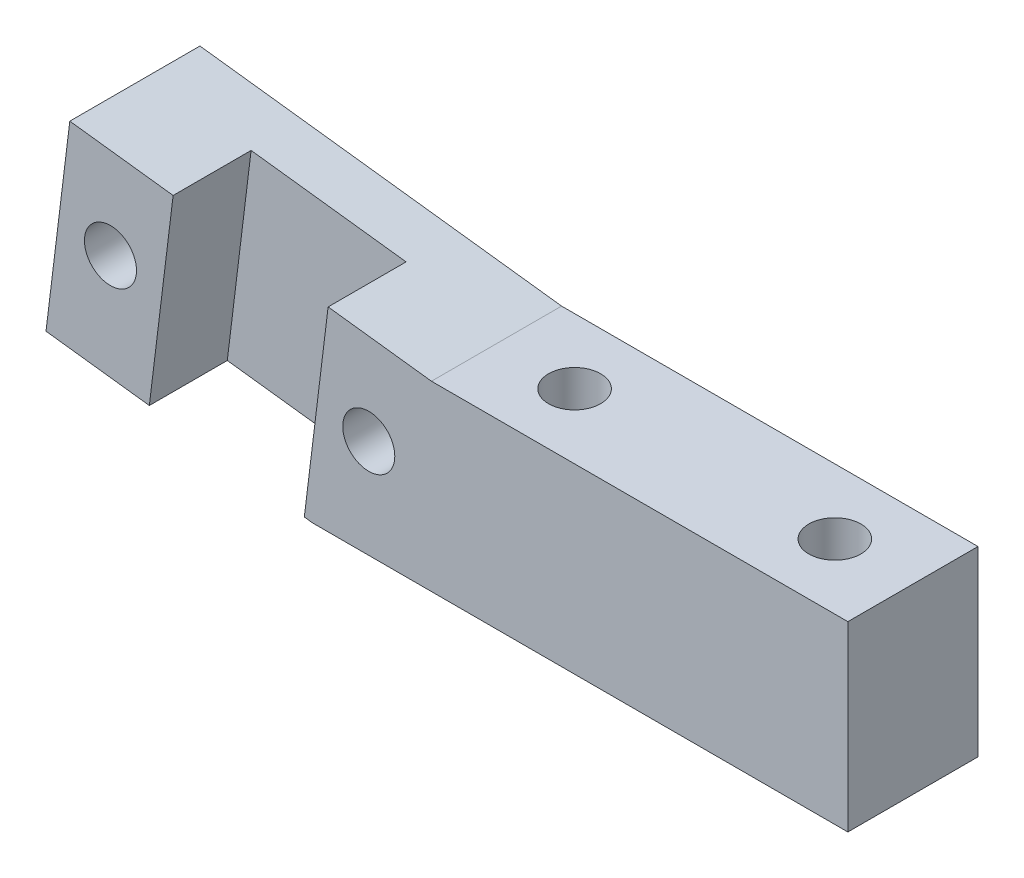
ISO-10303-21;
HEADER;
FILE_DESCRIPTION(('STEP AP214'),'2;1');
FILE_NAME('part.step','',(''),(''),'','','');
FILE_SCHEMA(('AUTOMOTIVE_DESIGN { 1 0 10303 214 1 1 1 1 }'));
ENDSEC;
DATA;
#1=APPLICATION_CONTEXT('core data for automotive mechanical design processes');
#2=APPLICATION_PROTOCOL_DEFINITION('international standard','automotive_design',2000,#1);
#3=PRODUCT_CONTEXT('',#1,'mechanical');
#4=PRODUCT('Part','Part','',(#3));
#5=PRODUCT_RELATED_PRODUCT_CATEGORY('part','',(#4));
#6=PRODUCT_DEFINITION_FORMATION('','',#4);
#7=PRODUCT_DEFINITION_CONTEXT('part definition',#1,'design');
#8=PRODUCT_DEFINITION('design','',#6,#7);
#9=PRODUCT_DEFINITION_SHAPE('','',#8);
#10=(LENGTH_UNIT() NAMED_UNIT(*) SI_UNIT(.MILLI.,.METRE.));
#11=(NAMED_UNIT(*) PLANE_ANGLE_UNIT() SI_UNIT($,.RADIAN.));
#12=(NAMED_UNIT(*) SI_UNIT($,.STERADIAN.) SOLID_ANGLE_UNIT());
#13=UNCERTAINTY_MEASURE_WITH_UNIT(LENGTH_MEASURE(1.E-05),#10,'distance_accuracy_value','');
#14=(GEOMETRIC_REPRESENTATION_CONTEXT(3) GLOBAL_UNCERTAINTY_ASSIGNED_CONTEXT((#13)) GLOBAL_UNIT_ASSIGNED_CONTEXT((#10,
#11,#12)) REPRESENTATION_CONTEXT('',''));
#15=CARTESIAN_POINT('',(0.,0.,0.));
#16=DIRECTION('',(0.,0.,1.));
#17=DIRECTION('',(1.,0.,0.));
#18=AXIS2_PLACEMENT_3D('',#15,#16,#17);
#19=CARTESIAN_POINT('',(0.,0.,7.9375));
#20=DIRECTION('',(0.,0.,-1.));
#21=DIRECTION('',(-1.,0.,0.));
#22=AXIS2_PLACEMENT_3D('',#19,#20,#21);
#23=PLANE('',#22);
#24=CARTESIAN_POINT('',(-39.16018690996,4.80826635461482,7.9375));
#25=DIRECTION('',(0.,0.,1.));
#26=DIRECTION('',(1.,0.,0.));
#27=AXIS2_PLACEMENT_3D('',#24,#25,#26);
#28=CIRCLE('',#27,3.175);
#29=CARTESIAN_POINT('',(-35.98518690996,4.80826635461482,7.9375));
#30=VERTEX_POINT('',#29);
#31=EDGE_CURVE('E206',#30,#30,#28,.T.);
#32=ORIENTED_EDGE('',*,*,#31,.F.);
#33=EDGE_LOOP('',(#32));
#34=FACE_BOUND('',#33,.T.);
#35=DIRECTION('',(-0.12186934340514,-0.992546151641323,0.));
#36=VECTOR('',#35,1.);
#37=CARTESIAN_POINT('',(-32.8575188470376,4.03439602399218,7.9375));
#38=LINE('',#37,#36);
#39=CARTESIAN_POINT('',(-31.513340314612,14.9818516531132,7.9375));
#40=VERTEX_POINT('',#39);
#41=CARTESIAN_POINT('',(-34.4169017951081,-8.66575891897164,7.9375));
#42=VERTEX_POINT('',#41);
#43=EDGE_CURVE('E202',#40,#42,#38,.T.);
#44=ORIENTED_EDGE('',*,*,#43,.F.);
#45=DIRECTION('',(-0.992546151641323,0.121869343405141,0.));
#46=VECTOR('',#45,1.);
#47=CARTESIAN_POINT('',(0.,11.1125,7.9375));
#48=LINE('',#47,#46);
#49=CARTESIAN_POINT('',(-44.1186764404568,16.5295923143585,7.9375));
#50=VERTEX_POINT('',#49);
#51=EDGE_CURVE('E124',#40,#50,#48,.T.);
#52=ORIENTED_EDGE('',*,*,#51,.T.);
#53=DIRECTION('',(-0.12186934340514,-0.992546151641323,0.));
#54=VECTOR('',#53,1.);
#55=CARTESIAN_POINT('',(-47.0222379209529,-7.11801825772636,7.9375));
#56=LINE('',#55,#54);
#57=CARTESIAN_POINT('',(-47.0222379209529,-7.11801825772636,7.9375));
#58=VERTEX_POINT('',#57);
#59=EDGE_CURVE('E117',#50,#58,#56,.T.);
#60=ORIENTED_EDGE('',*,*,#59,.T.);
#61=DIRECTION('',(0.992546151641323,-0.12186934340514,0.));
#62=VECTOR('',#61,1.);
#63=CARTESIAN_POINT('',(-14.4897948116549,-11.1125,7.9375));
#64=LINE('',#63,#62);
#65=EDGE_CURVE('E122',#58,#42,#64,.T.);
#66=ORIENTED_EDGE('',*,*,#65,.T.);
#67=EDGE_LOOP('',(#44,#52,#60,#66));
#68=FACE_BOUND('',#67,.T.);
#69=ADVANCED_FACE('F45',(#34,#68),#23,.F.);
#70=CARTESIAN_POINT('',(-7.64684659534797,0.938914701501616,7.9375));
#71=DIRECTION('',(0.,0.,1.));
#72=DIRECTION('',(1.,0.,0.));
#73=AXIS2_PLACEMENT_3D('',#70,#71,#72);
#74=CIRCLE('',#73,3.175);
#75=CARTESIAN_POINT('',(-4.47184659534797,0.938914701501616,7.9375));
#76=VERTEX_POINT('',#75);
#77=EDGE_CURVE('E153',#76,#76,#74,.T.);
#78=ORIENTED_EDGE('',*,*,#77,.F.);
#79=EDGE_LOOP('',(#78));
#80=FACE_BOUND('',#79,.T.);
#81=DIRECTION('',(0.12186934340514,0.992546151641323,0.));
#82=VECTOR('',#81,1.);
#83=CARTESIAN_POINT('',(-13.9495146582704,1.71278503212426,7.9375));
#84=LINE('',#83,#82);
#85=CARTESIAN_POINT('',(-15.5088976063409,-10.9873699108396,7.9375));
#86=VERTEX_POINT('',#85);
#87=CARTESIAN_POINT('',(-12.6053361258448,12.6602406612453,7.9375));
#88=VERTEX_POINT('',#87);
#89=EDGE_CURVE('E199',#86,#88,#84,.T.);
#90=ORIENTED_EDGE('',*,*,#89,.F.);
#91=CARTESIAN_POINT('',(-14.4897948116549,-11.1125,7.9375));
#92=VERTEX_POINT('',#91);
#93=EDGE_CURVE('E128',#86,#92,#64,.T.);
#94=ORIENTED_EDGE('',*,*,#93,.T.);
#95=DIRECTION('',(1.,0.,0.));
#96=VECTOR('',#95,1.);
#97=CARTESIAN_POINT('',(50.8,-11.1125,7.9375));
#98=LINE('',#97,#96);
#99=CARTESIAN_POINT('',(50.8,-11.1125,7.9375));
#100=VERTEX_POINT('',#99);
#101=EDGE_CURVE('E70',#92,#100,#98,.T.);
#102=ORIENTED_EDGE('',*,*,#101,.T.);
#103=DIRECTION('',(0.,1.,0.));
#104=VECTOR('',#103,1.);
#105=CARTESIAN_POINT('',(50.8,11.1125,7.9375));
#106=LINE('',#105,#104);
#107=CARTESIAN_POINT('',(50.8,11.1125,7.9375));
#108=VERTEX_POINT('',#107);
#109=EDGE_CURVE('E161',#100,#108,#106,.T.);
#110=ORIENTED_EDGE('',*,*,#109,.T.);
#111=DIRECTION('',(-1.,0.,0.));
#112=VECTOR('',#111,1.);
#113=CARTESIAN_POINT('',(0.,11.1125,7.9375));
#114=LINE('',#113,#112);
#115=CARTESIAN_POINT('',(0.,11.1125,7.9375));
#116=VERTEX_POINT('',#115);
#117=EDGE_CURVE('E106',#108,#116,#114,.T.);
#118=ORIENTED_EDGE('',*,*,#117,.T.);
#119=EDGE_CURVE('E129',#116,#88,#48,.T.);
#120=ORIENTED_EDGE('',*,*,#119,.T.);
#121=EDGE_LOOP('',(#90,#94,#102,#110,#118,#120));
#122=FACE_BOUND('',#121,.T.);
#123=ADVANCED_FACE('F221',(#80,#122),#23,.F.);
#124=CARTESIAN_POINT('',(0.,11.1125,7.9375));
#125=DIRECTION('',(-0.121869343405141,-0.992546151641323,0.));
#126=DIRECTION('',(0.992546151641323,-0.121869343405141,0.));
#127=AXIS2_PLACEMENT_3D('',#124,#125,#126);
#128=PLANE('',#127);
#129=DIRECTION('',(0.,0.,-1.));
#130=VECTOR('',#129,1.);
#131=CARTESIAN_POINT('',(-31.513340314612,14.9818516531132,14.3002));
#132=LINE('',#131,#130);
#133=CARTESIAN_POINT('',(-31.513340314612,14.9818516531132,-1.5748));
#134=VERTEX_POINT('',#133);
#135=EDGE_CURVE('E196',#40,#134,#132,.T.);
#136=ORIENTED_EDGE('',*,*,#135,.T.);
#137=DIRECTION('',(-0.992546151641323,0.121869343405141,0.));
#138=VECTOR('',#137,1.);
#139=CARTESIAN_POINT('',(-12.6053361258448,12.6602406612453,-1.5748));
#140=LINE('',#139,#138);
#141=CARTESIAN_POINT('',(-12.6053361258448,12.6602406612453,-1.5748));
#142=VERTEX_POINT('',#141);
#143=EDGE_CURVE('E178',#142,#134,#140,.T.);
#144=ORIENTED_EDGE('',*,*,#143,.F.);
#145=DIRECTION('',(0.,0.,-1.));
#146=VECTOR('',#145,1.);
#147=CARTESIAN_POINT('',(-12.6053361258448,12.6602406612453,14.3002));
#148=LINE('',#147,#146);
#149=EDGE_CURVE('E193',#88,#142,#148,.T.);
#150=ORIENTED_EDGE('',*,*,#149,.F.);
#151=ORIENTED_EDGE('',*,*,#119,.F.);
#152=DIRECTION('',(0.,0.,-1.));
#153=VECTOR('',#152,1.);
#154=CARTESIAN_POINT('',(0.,11.1125,7.9375));
#155=LINE('',#154,#153);
#156=CARTESIAN_POINT('',(0.,11.1125,-7.9375));
#157=VERTEX_POINT('',#156);
#158=EDGE_CURVE('E165',#116,#157,#155,.T.);
#159=ORIENTED_EDGE('',*,*,#158,.T.);
#160=DIRECTION('',(-0.992546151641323,0.121869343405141,0.));
#161=VECTOR('',#160,1.);
#162=CARTESIAN_POINT('',(0.,11.1125,-7.9375));
#163=LINE('',#162,#161);
#164=CARTESIAN_POINT('',(-44.1186764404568,16.5295923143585,-7.9375));
#165=VERTEX_POINT('',#164);
#166=EDGE_CURVE('E155',#157,#165,#163,.T.);
#167=ORIENTED_EDGE('',*,*,#166,.T.);
#168=DIRECTION('',(0.,0.,-1.));
#169=VECTOR('',#168,1.);
#170=CARTESIAN_POINT('',(-44.1186764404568,16.5295923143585,7.9375));
#171=LINE('',#170,#169);
#172=EDGE_CURVE('E138',#50,#165,#171,.T.);
#173=ORIENTED_EDGE('',*,*,#172,.F.);
#174=ORIENTED_EDGE('',*,*,#51,.F.);
#175=EDGE_LOOP('',(#136,#144,#150,#151,#159,#167,#173,#174));
#176=FACE_BOUND('',#175,.T.);
#177=ADVANCED_FACE('F228',(#176),#128,.F.);
#178=CARTESIAN_POINT('',(-14.4897948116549,-11.1125,7.9375));
#179=DIRECTION('',(0.12186934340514,0.992546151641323,0.));
#180=DIRECTION('',(-0.992546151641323,0.12186934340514,0.));
#181=AXIS2_PLACEMENT_3D('',#178,#179,#180);
#182=PLANE('',#181);
#183=DIRECTION('',(0.,0.,-1.));
#184=VECTOR('',#183,1.);
#185=CARTESIAN_POINT('',(-34.4169017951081,-8.66575891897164,7.9375));
#186=LINE('',#185,#184);
#187=CARTESIAN_POINT('',(-34.4169017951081,-8.66575891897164,-1.5748));
#188=VERTEX_POINT('',#187);
#189=EDGE_CURVE('E13',#42,#188,#186,.T.);
#190=ORIENTED_EDGE('',*,*,#189,.F.);
#191=ORIENTED_EDGE('',*,*,#65,.F.);
#192=DIRECTION('',(0.,0.,-1.));
#193=VECTOR('',#192,1.);
#194=CARTESIAN_POINT('',(-47.0222379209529,-7.11801825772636,7.9375));
#195=LINE('',#194,#193);
#196=CARTESIAN_POINT('',(-47.0222379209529,-7.11801825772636,-7.9375));
#197=VERTEX_POINT('',#196);
#198=EDGE_CURVE('E132',#58,#197,#195,.T.);
#199=ORIENTED_EDGE('',*,*,#198,.T.);
#200=DIRECTION('',(0.992546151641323,-0.12186934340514,0.));
#201=VECTOR('',#200,1.);
#202=CARTESIAN_POINT('',(-14.4897948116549,-11.1125,-7.9375));
#203=LINE('',#202,#201);
#204=CARTESIAN_POINT('',(-14.4897948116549,-11.1125,-7.9375));
#205=VERTEX_POINT('',#204);
#206=EDGE_CURVE('E158',#197,#205,#203,.T.);
#207=ORIENTED_EDGE('',*,*,#206,.T.);
#208=DIRECTION('',(0.,0.,-1.));
#209=VECTOR('',#208,1.);
#210=CARTESIAN_POINT('',(-14.4897948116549,-11.1125,7.9375));
#211=LINE('',#210,#209);
#212=EDGE_CURVE('E139',#92,#205,#211,.T.);
#213=ORIENTED_EDGE('',*,*,#212,.F.);
#214=ORIENTED_EDGE('',*,*,#93,.F.);
#215=DIRECTION('',(0.,0.,1.));
#216=VECTOR('',#215,1.);
#217=CARTESIAN_POINT('',(-15.5088976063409,-10.9873699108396,7.9375));
#218=LINE('',#217,#216);
#219=CARTESIAN_POINT('',(-15.5088976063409,-10.9873699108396,-1.5748));
#220=VERTEX_POINT('',#219);
#221=EDGE_CURVE('E54',#220,#86,#218,.T.);
#222=ORIENTED_EDGE('',*,*,#221,.F.);
#223=DIRECTION('',(0.992546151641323,-0.12186934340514,0.));
#224=VECTOR('',#223,1.);
#225=CARTESIAN_POINT('',(-15.5088976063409,-10.9873699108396,-1.5748));
#226=LINE('',#225,#224);
#227=EDGE_CURVE('E188',#188,#220,#226,.T.);
#228=ORIENTED_EDGE('',*,*,#227,.F.);
#229=EDGE_LOOP('',(#190,#191,#199,#207,#213,#214,#222,#228));
#230=FACE_BOUND('',#229,.T.);
#231=ADVANCED_FACE('F142',(#230),#182,.F.);
#232=CARTESIAN_POINT('',(0.,0.,-7.9375));
#233=DIRECTION('',(0.,0.,-1.));
#234=DIRECTION('',(-1.,0.,0.));
#235=AXIS2_PLACEMENT_3D('',#232,#233,#234);
#236=PLANE('',#235);
#237=CARTESIAN_POINT('',(-7.64684659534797,0.938914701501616,-7.9375));
#238=DIRECTION('',(0.,0.,1.));
#239=DIRECTION('',(1.,0.,0.));
#240=AXIS2_PLACEMENT_3D('',#237,#238,#239);
#241=CIRCLE('',#240,3.175);
#242=CARTESIAN_POINT('',(-4.47184659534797,0.938914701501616,-7.9375));
#243=VERTEX_POINT('',#242);
#244=EDGE_CURVE('E209',#243,#243,#241,.T.);
#245=ORIENTED_EDGE('',*,*,#244,.T.);
#246=EDGE_LOOP('',(#245));
#247=FACE_BOUND('',#246,.T.);
#248=DIRECTION('',(0.,1.,0.));
#249=VECTOR('',#248,1.);
#250=CARTESIAN_POINT('',(50.8,11.1125,-7.9375));
#251=LINE('',#250,#249);
#252=CARTESIAN_POINT('',(50.8,-11.1125,-7.9375));
#253=VERTEX_POINT('',#252);
#254=CARTESIAN_POINT('',(50.8,11.1125,-7.9375));
#255=VERTEX_POINT('',#254);
#256=EDGE_CURVE('E149',#253,#255,#251,.T.);
#257=ORIENTED_EDGE('',*,*,#256,.F.);
#258=DIRECTION('',(1.,0.,0.));
#259=VECTOR('',#258,1.);
#260=CARTESIAN_POINT('',(50.8,-11.1125,-7.9375));
#261=LINE('',#260,#259);
#262=EDGE_CURVE('E97',#205,#253,#261,.T.);
#263=ORIENTED_EDGE('',*,*,#262,.F.);
#264=ORIENTED_EDGE('',*,*,#206,.F.);
#265=DIRECTION('',(-0.12186934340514,-0.992546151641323,0.));
#266=VECTOR('',#265,1.);
#267=CARTESIAN_POINT('',(-47.0222379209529,-7.11801825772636,-7.9375));
#268=LINE('',#267,#266);
#269=EDGE_CURVE('E135',#165,#197,#268,.T.);
#270=ORIENTED_EDGE('',*,*,#269,.F.);
#271=ORIENTED_EDGE('',*,*,#166,.F.);
#272=DIRECTION('',(-1.,0.,0.));
#273=VECTOR('',#272,1.);
#274=CARTESIAN_POINT('',(0.,11.1125,-7.9375));
#275=LINE('',#274,#273);
#276=EDGE_CURVE('E152',#255,#157,#275,.T.);
#277=ORIENTED_EDGE('',*,*,#276,.F.);
#278=EDGE_LOOP('',(#257,#263,#264,#270,#271,#277));
#279=FACE_BOUND('',#278,.T.);
#280=CARTESIAN_POINT('',(-39.16018690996,4.80826635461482,-7.9375));
#281=DIRECTION('',(0.,0.,1.));
#282=DIRECTION('',(1.,0.,0.));
#283=AXIS2_PLACEMENT_3D('',#280,#281,#282);
#284=CIRCLE('',#283,3.175);
#285=CARTESIAN_POINT('',(-35.98518690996,4.80826635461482,-7.9375));
#286=VERTEX_POINT('',#285);
#287=EDGE_CURVE('E205',#286,#286,#284,.T.);
#288=ORIENTED_EDGE('',*,*,#287,.T.);
#289=EDGE_LOOP('',(#288));
#290=FACE_BOUND('',#289,.T.);
#291=ADVANCED_FACE('F248',(#247,#279,#290),#236,.T.);
#292=CARTESIAN_POINT('',(50.8,11.1125,7.9375));
#293=DIRECTION('',(-1.,0.,0.));
#294=DIRECTION('',(0.,0.,1.));
#295=AXIS2_PLACEMENT_3D('',#292,#293,#294);
#296=PLANE('',#295);
#297=ORIENTED_EDGE('',*,*,#256,.T.);
#298=DIRECTION('',(0.,0.,-1.));
#299=VECTOR('',#298,1.);
#300=CARTESIAN_POINT('',(50.8,11.1125,7.9375));
#301=LINE('',#300,#299);
#302=EDGE_CURVE('E168',#108,#255,#301,.T.);
#303=ORIENTED_EDGE('',*,*,#302,.F.);
#304=ORIENTED_EDGE('',*,*,#109,.F.);
#305=DIRECTION('',(0.,0.,-1.));
#306=VECTOR('',#305,1.);
#307=CARTESIAN_POINT('',(50.8,-11.1125,7.9375));
#308=LINE('',#307,#306);
#309=EDGE_CURVE('E145',#100,#253,#308,.T.);
#310=ORIENTED_EDGE('',*,*,#309,.T.);
#311=EDGE_LOOP('',(#297,#303,#304,#310));
#312=FACE_BOUND('',#311,.T.);
#313=ADVANCED_FACE('F47',(#312),#296,.F.);
#314=CARTESIAN_POINT('',(0.,11.1125,7.9375));
#315=DIRECTION('',(0.,-1.,0.));
#316=DIRECTION('',(0.,0.,-1.));
#317=AXIS2_PLACEMENT_3D('',#314,#315,#316);
#318=PLANE('',#317);
#319=CARTESIAN_POINT('',(41.275,11.1125,0.));
#320=DIRECTION('',(0.,-1.,0.));
#321=DIRECTION('',(0.,0.,-1.));
#322=AXIS2_PLACEMENT_3D('',#319,#320,#321);
#323=CIRCLE('',#322,3.175);
#324=CARTESIAN_POINT('',(41.275,11.1125,-3.175));
#325=VERTEX_POINT('',#324);
#326=EDGE_CURVE('E174',#325,#325,#323,.T.);
#327=ORIENTED_EDGE('',*,*,#326,.T.);
#328=EDGE_LOOP('',(#327));
#329=FACE_BOUND('',#328,.T.);
#330=CARTESIAN_POINT('',(9.525,11.1125,0.));
#331=DIRECTION('',(0.,-1.,0.));
#332=DIRECTION('',(0.,0.,-1.));
#333=AXIS2_PLACEMENT_3D('',#330,#331,#332);
#334=CIRCLE('',#333,3.175);
#335=CARTESIAN_POINT('',(9.525,11.1125,-3.175));
#336=VERTEX_POINT('',#335);
#337=EDGE_CURVE('E173',#336,#336,#334,.T.);
#338=ORIENTED_EDGE('',*,*,#337,.T.);
#339=EDGE_LOOP('',(#338));
#340=FACE_BOUND('',#339,.T.);
#341=ORIENTED_EDGE('',*,*,#276,.T.);
#342=ORIENTED_EDGE('',*,*,#158,.F.);
#343=ORIENTED_EDGE('',*,*,#117,.F.);
#344=ORIENTED_EDGE('',*,*,#302,.T.);
#345=EDGE_LOOP('',(#341,#342,#343,#344));
#346=FACE_BOUND('',#345,.T.);
#347=ADVANCED_FACE('F254',(#329,#340,#346),#318,.F.);
#348=CARTESIAN_POINT('',(-47.0222379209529,-7.11801825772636,7.9375));
#349=DIRECTION('',(0.992546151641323,-0.12186934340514,0.));
#350=DIRECTION('',(0.12186934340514,0.992546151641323,0.));
#351=AXIS2_PLACEMENT_3D('',#348,#349,#350);
#352=PLANE('',#351);
#353=ORIENTED_EDGE('',*,*,#269,.T.);
#354=ORIENTED_EDGE('',*,*,#198,.F.);
#355=ORIENTED_EDGE('',*,*,#59,.F.);
#356=ORIENTED_EDGE('',*,*,#172,.T.);
#357=EDGE_LOOP('',(#353,#354,#355,#356));
#358=FACE_BOUND('',#357,.T.);
#359=ADVANCED_FACE('F133',(#358),#352,.F.);
#360=CARTESIAN_POINT('',(50.8,-11.1125,7.9375));
#361=DIRECTION('',(0.,1.,0.));
#362=DIRECTION('',(-1.,0.,0.));
#363=AXIS2_PLACEMENT_3D('',#360,#361,#362);
#364=PLANE('',#363);
#365=CARTESIAN_POINT('',(41.275,-11.1125,0.));
#366=DIRECTION('',(0.,1.,0.));
#367=DIRECTION('',(-1.,0.,0.));
#368=AXIS2_PLACEMENT_3D('',#365,#366,#367);
#369=CIRCLE('',#368,3.175);
#370=CARTESIAN_POINT('',(38.1,-11.1125,0.));
#371=VERTEX_POINT('',#370);
#372=EDGE_CURVE('E49',#371,#371,#369,.T.);
#373=ORIENTED_EDGE('',*,*,#372,.T.);
#374=EDGE_LOOP('',(#373));
#375=FACE_BOUND('',#374,.T.);
#376=CARTESIAN_POINT('',(9.525,-11.1125,0.));
#377=DIRECTION('',(0.,1.,0.));
#378=DIRECTION('',(-1.,0.,0.));
#379=AXIS2_PLACEMENT_3D('',#376,#377,#378);
#380=CIRCLE('',#379,3.175);
#381=CARTESIAN_POINT('',(6.35,-11.1125,0.));
#382=VERTEX_POINT('',#381);
#383=EDGE_CURVE('E171',#382,#382,#380,.T.);
#384=ORIENTED_EDGE('',*,*,#383,.T.);
#385=EDGE_LOOP('',(#384));
#386=FACE_BOUND('',#385,.T.);
#387=ORIENTED_EDGE('',*,*,#262,.T.);
#388=ORIENTED_EDGE('',*,*,#309,.F.);
#389=ORIENTED_EDGE('',*,*,#101,.F.);
#390=ORIENTED_EDGE('',*,*,#212,.T.);
#391=EDGE_LOOP('',(#387,#388,#389,#390));
#392=FACE_BOUND('',#391,.T.);
#393=ADVANCED_FACE('F250',(#375,#386,#392),#364,.F.);
#394=CARTESIAN_POINT('',(-7.64684659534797,0.938914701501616,7.9375));
#395=DIRECTION('',(0.,0.,-1.));
#396=DIRECTION('',(-1.,0.,0.));
#397=AXIS2_PLACEMENT_3D('',#394,#395,#396);
#398=CYLINDRICAL_SURFACE('',#397,3.175);
#399=ORIENTED_EDGE('',*,*,#77,.T.);
#400=EDGE_LOOP('',(#399));
#401=FACE_BOUND('',#400,.T.);
#402=ORIENTED_EDGE('',*,*,#244,.F.);
#403=EDGE_LOOP('',(#402));
#404=FACE_BOUND('',#403,.T.);
#405=ADVANCED_FACE('F273',(#401,#404),#398,.F.);
#406=CARTESIAN_POINT('',(-39.16018690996,4.80826635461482,7.9375));
#407=DIRECTION('',(0.,0.,-1.));
#408=DIRECTION('',(-1.,0.,0.));
#409=AXIS2_PLACEMENT_3D('',#406,#407,#408);
#410=CYLINDRICAL_SURFACE('',#409,3.175);
#411=ORIENTED_EDGE('',*,*,#31,.T.);
#412=EDGE_LOOP('',(#411));
#413=FACE_BOUND('',#412,.T.);
#414=ORIENTED_EDGE('',*,*,#287,.F.);
#415=EDGE_LOOP('',(#414));
#416=FACE_BOUND('',#415,.T.);
#417=ADVANCED_FACE('F317',(#413,#416),#410,.F.);
#418=CARTESIAN_POINT('',(-31.513340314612,14.9818516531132,14.3002));
#419=DIRECTION('',(0.992546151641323,-0.12186934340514,0.));
#420=DIRECTION('',(0.12186934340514,0.992546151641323,0.));
#421=AXIS2_PLACEMENT_3D('',#418,#419,#420);
#422=PLANE('',#421);
#423=ORIENTED_EDGE('',*,*,#43,.T.);
#424=ORIENTED_EDGE('',*,*,#189,.T.);
#425=DIRECTION('',(-0.12186934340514,-0.992546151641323,0.));
#426=VECTOR('',#425,1.);
#427=CARTESIAN_POINT('',(-31.513340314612,14.9818516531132,-1.5748));
#428=LINE('',#427,#426);
#429=EDGE_CURVE('E62',#134,#188,#428,.T.);
#430=ORIENTED_EDGE('',*,*,#429,.F.);
#431=ORIENTED_EDGE('',*,*,#135,.F.);
#432=EDGE_LOOP('',(#423,#424,#430,#431));
#433=FACE_BOUND('',#432,.T.);
#434=ADVANCED_FACE('F245',(#433),#422,.T.);
#435=CARTESIAN_POINT('',(-12.6053361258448,12.6602406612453,14.3002));
#436=DIRECTION('',(-0.992546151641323,0.12186934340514,0.));
#437=DIRECTION('',(-0.12186934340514,-0.992546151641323,0.));
#438=AXIS2_PLACEMENT_3D('',#435,#436,#437);
#439=PLANE('',#438);
#440=ORIENTED_EDGE('',*,*,#89,.T.);
#441=ORIENTED_EDGE('',*,*,#149,.T.);
#442=DIRECTION('',(0.12186934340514,0.992546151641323,0.));
#443=VECTOR('',#442,1.);
#444=CARTESIAN_POINT('',(-12.6053361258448,12.6602406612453,-1.5748));
#445=LINE('',#444,#443);
#446=EDGE_CURVE('E190',#220,#142,#445,.T.);
#447=ORIENTED_EDGE('',*,*,#446,.F.);
#448=ORIENTED_EDGE('',*,*,#221,.T.);
#449=EDGE_LOOP('',(#440,#441,#447,#448));
#450=FACE_BOUND('',#449,.T.);
#451=ADVANCED_FACE('F233',(#450),#439,.T.);
#452=CARTESIAN_POINT('',(0.,0.,-1.5748));
#453=DIRECTION('',(0.,0.,1.));
#454=DIRECTION('',(1.,0.,0.));
#455=AXIS2_PLACEMENT_3D('',#452,#453,#454);
#456=PLANE('',#455);
#457=ORIENTED_EDGE('',*,*,#143,.T.);
#458=ORIENTED_EDGE('',*,*,#429,.T.);
#459=ORIENTED_EDGE('',*,*,#227,.T.);
#460=ORIENTED_EDGE('',*,*,#446,.T.);
#461=EDGE_LOOP('',(#457,#458,#459,#460));
#462=FACE_BOUND('',#461,.T.);
#463=ADVANCED_FACE('F237',(#462),#456,.T.);
#464=CARTESIAN_POINT('',(9.525,-25.4,0.));
#465=DIRECTION('',(0.,1.,0.));
#466=DIRECTION('',(0.,0.,1.));
#467=AXIS2_PLACEMENT_3D('',#464,#465,#466);
#468=CYLINDRICAL_SURFACE('',#467,3.175);
#469=ORIENTED_EDGE('',*,*,#383,.F.);
#470=EDGE_LOOP('',(#469));
#471=FACE_BOUND('',#470,.T.);
#472=ORIENTED_EDGE('',*,*,#337,.F.);
#473=EDGE_LOOP('',(#472));
#474=FACE_BOUND('',#473,.T.);
#475=ADVANCED_FACE('F360',(#471,#474),#468,.F.);
#476=CARTESIAN_POINT('',(41.275,-25.4,0.));
#477=DIRECTION('',(0.,1.,0.));
#478=DIRECTION('',(0.,0.,1.));
#479=AXIS2_PLACEMENT_3D('',#476,#477,#478);
#480=CYLINDRICAL_SURFACE('',#479,3.175);
#481=ORIENTED_EDGE('',*,*,#372,.F.);
#482=EDGE_LOOP('',(#481));
#483=FACE_BOUND('',#482,.T.);
#484=ORIENTED_EDGE('',*,*,#326,.F.);
#485=EDGE_LOOP('',(#484));
#486=FACE_BOUND('',#485,.T.);
#487=ADVANCED_FACE('F368',(#483,#486),#480,.F.);
#488=CLOSED_SHELL('',(#69,#123,#177,#231,#291,#313,#347,#359,#393,#405,#417,#434,#451,#463,#475,#487));
#489=MANIFOLD_SOLID_BREP('B2',#488);
#490=ADVANCED_BREP_SHAPE_REPRESENTATION('',(#18,#489),#14);
#491=SHAPE_DEFINITION_REPRESENTATION(#9,#490);
ENDSEC;
END-ISO-10303-21;
